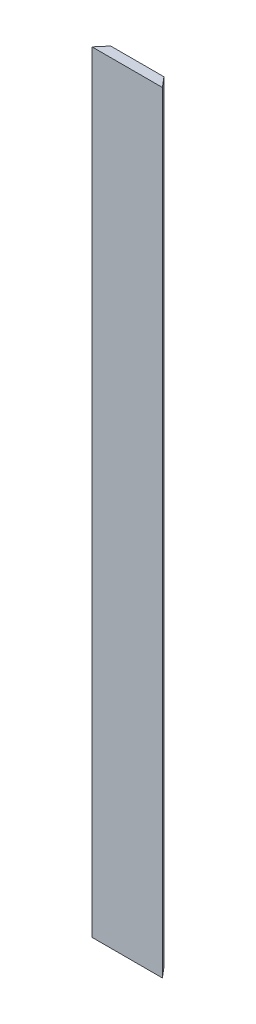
ISO-10303-21;
HEADER;
FILE_DESCRIPTION(('STEP AP214'),'2;1');
FILE_NAME('part.step','',(''),(''),'','','');
FILE_SCHEMA(('AUTOMOTIVE_DESIGN { 1 0 10303 214 1 1 1 1 }'));
ENDSEC;
DATA;
#1=APPLICATION_CONTEXT('core data for automotive mechanical design processes');
#2=APPLICATION_PROTOCOL_DEFINITION('international standard','automotive_design',2000,#1);
#3=PRODUCT_CONTEXT('',#1,'mechanical');
#4=PRODUCT('Part','Part','',(#3));
#5=PRODUCT_RELATED_PRODUCT_CATEGORY('part','',(#4));
#6=PRODUCT_DEFINITION_FORMATION('','',#4);
#7=PRODUCT_DEFINITION_CONTEXT('part definition',#1,'design');
#8=PRODUCT_DEFINITION('design','',#6,#7);
#9=PRODUCT_DEFINITION_SHAPE('','',#8);
#10=(LENGTH_UNIT() NAMED_UNIT(*) SI_UNIT(.MILLI.,.METRE.));
#11=(NAMED_UNIT(*) PLANE_ANGLE_UNIT() SI_UNIT($,.RADIAN.));
#12=(NAMED_UNIT(*) SI_UNIT($,.STERADIAN.) SOLID_ANGLE_UNIT());
#13=UNCERTAINTY_MEASURE_WITH_UNIT(LENGTH_MEASURE(1.E-05),#10,'distance_accuracy_value','');
#14=(GEOMETRIC_REPRESENTATION_CONTEXT(3) GLOBAL_UNCERTAINTY_ASSIGNED_CONTEXT((#13)) GLOBAL_UNIT_ASSIGNED_CONTEXT((#10,
#11,#12)) REPRESENTATION_CONTEXT('',''));
#15=CARTESIAN_POINT('',(0.,0.,0.));
#16=DIRECTION('',(0.,0.,1.));
#17=DIRECTION('',(1.,0.,0.));
#18=AXIS2_PLACEMENT_3D('',#15,#16,#17);
#19=CARTESIAN_POINT('',(13.49375,1219.2,-15.875));
#20=DIRECTION('',(0.761939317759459,0.,0.64764842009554));
#21=DIRECTION('',(0.647648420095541,0.,-0.761939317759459));
#22=AXIS2_PLACEMENT_3D('',#19,#20,#21);
#23=PLANE('',#22);
#24=DIRECTION('',(-0.64764842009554,0.,0.761939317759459));
#25=VECTOR('',#24,1.);
#26=CARTESIAN_POINT('',(13.49375,0.,-15.875));
#27=LINE('',#26,#25);
#28=CARTESIAN_POINT('',(13.49375,0.,-15.875));
#29=VERTEX_POINT('',#28);
#30=CARTESIAN_POINT('',(0.,0.,0.));
#31=VERTEX_POINT('',#30);
#32=EDGE_CURVE('E95',#29,#31,#27,.T.);
#33=ORIENTED_EDGE('',*,*,#32,.T.);
#34=DIRECTION('',(0.,-1.,0.));
#35=VECTOR('',#34,1.);
#36=CARTESIAN_POINT('',(0.,1219.2,0.));
#37=LINE('',#36,#35);
#38=CARTESIAN_POINT('',(0.,1219.2,0.));
#39=VERTEX_POINT('',#38);
#40=EDGE_CURVE('E11',#39,#31,#37,.T.);
#41=ORIENTED_EDGE('',*,*,#40,.F.);
#42=DIRECTION('',(-0.64764842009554,0.,0.761939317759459));
#43=VECTOR('',#42,1.);
#44=CARTESIAN_POINT('',(13.49375,1219.2,-15.875));
#45=LINE('',#44,#43);
#46=CARTESIAN_POINT('',(13.49375,1219.2,-15.875));
#47=VERTEX_POINT('',#46);
#48=EDGE_CURVE('E83',#47,#39,#45,.T.);
#49=ORIENTED_EDGE('',*,*,#48,.F.);
#50=DIRECTION('',(0.,-1.,0.));
#51=VECTOR('',#50,1.);
#52=CARTESIAN_POINT('',(13.49375,1219.2,-15.875));
#53=LINE('',#52,#51);
#54=EDGE_CURVE('E91',#47,#29,#53,.T.);
#55=ORIENTED_EDGE('',*,*,#54,.T.);
#56=EDGE_LOOP('',(#33,#41,#49,#55));
#57=FACE_BOUND('',#56,.T.);
#58=ADVANCED_FACE('F32',(#57),#23,.F.);
#59=CARTESIAN_POINT('',(0.,1219.2,0.));
#60=DIRECTION('',(0.,0.,-1.));
#61=DIRECTION('',(-1.,0.,0.));
#62=AXIS2_PLACEMENT_3D('',#59,#60,#61);
#63=PLANE('',#62);
#64=DIRECTION('',(1.,0.,0.));
#65=VECTOR('',#64,1.);
#66=CARTESIAN_POINT('',(0.,0.,0.));
#67=LINE('',#66,#65);
#68=CARTESIAN_POINT('',(111.125,0.,0.));
#69=VERTEX_POINT('',#68);
#70=EDGE_CURVE('E87',#31,#69,#67,.T.);
#71=ORIENTED_EDGE('',*,*,#70,.T.);
#72=DIRECTION('',(0.,-1.,0.));
#73=VECTOR('',#72,1.);
#74=CARTESIAN_POINT('',(111.125,1219.2,0.));
#75=LINE('',#74,#73);
#76=CARTESIAN_POINT('',(111.125,1219.2,0.));
#77=VERTEX_POINT('',#76);
#78=EDGE_CURVE('E40',#77,#69,#75,.T.);
#79=ORIENTED_EDGE('',*,*,#78,.F.);
#80=DIRECTION('',(1.,0.,0.));
#81=VECTOR('',#80,1.);
#82=CARTESIAN_POINT('',(0.,1219.2,0.));
#83=LINE('',#82,#81);
#84=EDGE_CURVE('E78',#39,#77,#83,.T.);
#85=ORIENTED_EDGE('',*,*,#84,.F.);
#86=ORIENTED_EDGE('',*,*,#40,.T.);
#87=EDGE_LOOP('',(#71,#79,#85,#86));
#88=FACE_BOUND('',#87,.T.);
#89=ADVANCED_FACE('F86',(#88),#63,.F.);
#90=CARTESIAN_POINT('',(111.125,1219.2,0.));
#91=DIRECTION('',(-0.761939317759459,0.,0.64764842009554));
#92=DIRECTION('',(0.64764842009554,0.,0.761939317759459));
#93=AXIS2_PLACEMENT_3D('',#90,#91,#92);
#94=PLANE('',#93);
#95=DIRECTION('',(-0.64764842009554,0.,-0.761939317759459));
#96=VECTOR('',#95,1.);
#97=CARTESIAN_POINT('',(111.125,0.,0.));
#98=LINE('',#97,#96);
#99=CARTESIAN_POINT('',(97.63125,0.,-15.875));
#100=VERTEX_POINT('',#99);
#101=EDGE_CURVE('E65',#69,#100,#98,.T.);
#102=ORIENTED_EDGE('',*,*,#101,.T.);
#103=DIRECTION('',(0.,-1.,0.));
#104=VECTOR('',#103,1.);
#105=CARTESIAN_POINT('',(97.63125,1219.2,-15.875));
#106=LINE('',#105,#104);
#107=CARTESIAN_POINT('',(97.63125,1219.2,-15.875));
#108=VERTEX_POINT('',#107);
#109=EDGE_CURVE('E88',#108,#100,#106,.T.);
#110=ORIENTED_EDGE('',*,*,#109,.F.);
#111=DIRECTION('',(-0.64764842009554,0.,-0.761939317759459));
#112=VECTOR('',#111,1.);
#113=CARTESIAN_POINT('',(111.125,1219.2,0.));
#114=LINE('',#113,#112);
#115=EDGE_CURVE('E81',#77,#108,#114,.T.);
#116=ORIENTED_EDGE('',*,*,#115,.F.);
#117=ORIENTED_EDGE('',*,*,#78,.T.);
#118=EDGE_LOOP('',(#102,#110,#116,#117));
#119=FACE_BOUND('',#118,.T.);
#120=ADVANCED_FACE('F89',(#119),#94,.F.);
#121=CARTESIAN_POINT('',(97.63125,1219.2,-15.875));
#122=DIRECTION('',(0.,0.,1.));
#123=DIRECTION('',(1.,0.,0.));
#124=AXIS2_PLACEMENT_3D('',#121,#122,#123);
#125=PLANE('',#124);
#126=DIRECTION('',(-1.,0.,0.));
#127=VECTOR('',#126,1.);
#128=CARTESIAN_POINT('',(97.63125,0.,-15.875));
#129=LINE('',#128,#127);
#130=EDGE_CURVE('E71',#100,#29,#129,.T.);
#131=ORIENTED_EDGE('',*,*,#130,.T.);
#132=ORIENTED_EDGE('',*,*,#54,.F.);
#133=DIRECTION('',(-1.,0.,0.));
#134=VECTOR('',#133,1.);
#135=CARTESIAN_POINT('',(97.63125,1219.2,-15.875));
#136=LINE('',#135,#134);
#137=EDGE_CURVE('E48',#108,#47,#136,.T.);
#138=ORIENTED_EDGE('',*,*,#137,.F.);
#139=ORIENTED_EDGE('',*,*,#109,.T.);
#140=EDGE_LOOP('',(#131,#132,#138,#139));
#141=FACE_BOUND('',#140,.T.);
#142=ADVANCED_FACE('F102',(#141),#125,.F.);
#143=CARTESIAN_POINT('',(0.,1219.2,0.));
#144=DIRECTION('',(0.,-1.,0.));
#145=DIRECTION('',(0.,0.,-1.));
#146=AXIS2_PLACEMENT_3D('',#143,#144,#145);
#147=PLANE('',#146);
#148=ORIENTED_EDGE('',*,*,#48,.T.);
#149=ORIENTED_EDGE('',*,*,#84,.T.);
#150=ORIENTED_EDGE('',*,*,#115,.T.);
#151=ORIENTED_EDGE('',*,*,#137,.T.);
#152=EDGE_LOOP('',(#148,#149,#150,#151));
#153=FACE_BOUND('',#152,.T.);
#154=ADVANCED_FACE('F79',(#153),#147,.F.);
#155=CARTESIAN_POINT('',(0.,0.,0.));
#156=DIRECTION('',(0.,-1.,0.));
#157=DIRECTION('',(0.,0.,-1.));
#158=AXIS2_PLACEMENT_3D('',#155,#156,#157);
#159=PLANE('',#158);
#160=ORIENTED_EDGE('',*,*,#32,.F.);
#161=ORIENTED_EDGE('',*,*,#130,.F.);
#162=ORIENTED_EDGE('',*,*,#101,.F.);
#163=ORIENTED_EDGE('',*,*,#70,.F.);
#164=EDGE_LOOP('',(#160,#161,#162,#163));
#165=FACE_BOUND('',#164,.T.);
#166=ADVANCED_FACE('F105',(#165),#159,.T.);
#167=CLOSED_SHELL('',(#58,#89,#120,#142,#154,#166));
#168=MANIFOLD_SOLID_BREP('B2',#167);
#169=ADVANCED_BREP_SHAPE_REPRESENTATION('',(#18,#168),#14);
#170=SHAPE_DEFINITION_REPRESENTATION(#9,#169);
ENDSEC;
END-ISO-10303-21;
